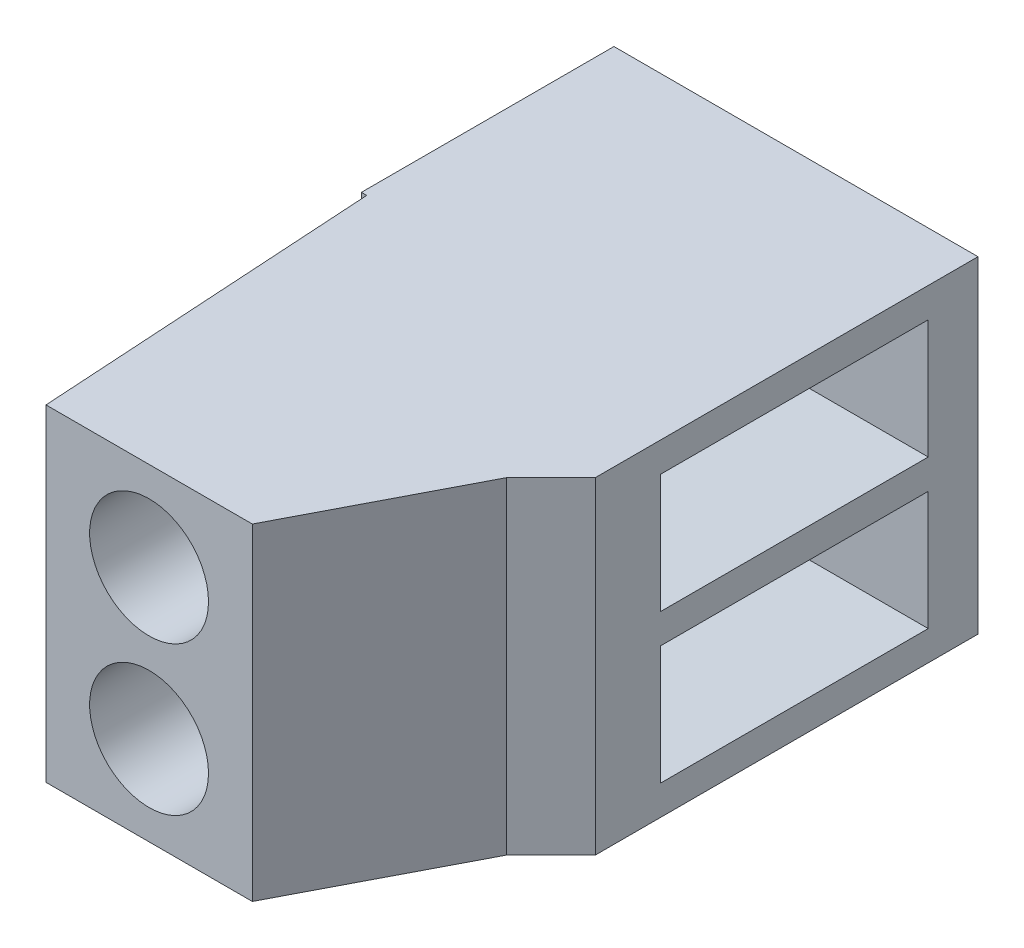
ISO-10303-21;
HEADER;
FILE_DESCRIPTION(('STEP AP214'),'2;1');
FILE_NAME('part.step','',(''),(''),'','','');
FILE_SCHEMA(('AUTOMOTIVE_DESIGN { 1 0 10303 214 1 1 1 1 }'));
ENDSEC;
DATA;
#1=APPLICATION_CONTEXT('core data for automotive mechanical design processes');
#2=APPLICATION_PROTOCOL_DEFINITION('international standard','automotive_design',2000,#1);
#3=PRODUCT_CONTEXT('',#1,'mechanical');
#4=PRODUCT('Part','Part','',(#3));
#5=PRODUCT_RELATED_PRODUCT_CATEGORY('part','',(#4));
#6=PRODUCT_DEFINITION_FORMATION('','',#4);
#7=PRODUCT_DEFINITION_CONTEXT('part definition',#1,'design');
#8=PRODUCT_DEFINITION('design','',#6,#7);
#9=PRODUCT_DEFINITION_SHAPE('','',#8);
#10=(LENGTH_UNIT() NAMED_UNIT(*) SI_UNIT(.MILLI.,.METRE.));
#11=(NAMED_UNIT(*) PLANE_ANGLE_UNIT() SI_UNIT($,.RADIAN.));
#12=(NAMED_UNIT(*) SI_UNIT($,.STERADIAN.) SOLID_ANGLE_UNIT());
#13=UNCERTAINTY_MEASURE_WITH_UNIT(LENGTH_MEASURE(1.E-05),#10,'distance_accuracy_value','');
#14=(GEOMETRIC_REPRESENTATION_CONTEXT(3) GLOBAL_UNCERTAINTY_ASSIGNED_CONTEXT((#13)) GLOBAL_UNIT_ASSIGNED_CONTEXT((#10,
#11,#12)) REPRESENTATION_CONTEXT('',''));
#15=CARTESIAN_POINT('',(0.,0.,0.));
#16=DIRECTION('',(0.,0.,1.));
#17=DIRECTION('',(1.,0.,0.));
#18=AXIS2_PLACEMENT_3D('',#15,#16,#17);
#19=CARTESIAN_POINT('',(0.,-14.7083329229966,-1.13686837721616E-10));
#20=DIRECTION('',(1.,0.,0.));
#21=DIRECTION('',(0.,0.,-1.));
#22=AXIS2_PLACEMENT_3D('',#19,#20,#21);
#23=PLANE('',#22);
#24=DIRECTION('',(0.,-1.,0.));
#25=VECTOR('',#24,1.);
#26=CARTESIAN_POINT('',(0.,-2.286,0.850899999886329));
#27=LINE('',#26,#25);
#28=CARTESIAN_POINT('',(0.,-0.253999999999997,0.850899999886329));
#29=VERTEX_POINT('',#28);
#30=CARTESIAN_POINT('',(0.,-2.286,0.850899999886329));
#31=VERTEX_POINT('',#30);
#32=EDGE_CURVE('E201',#29,#31,#27,.T.);
#33=ORIENTED_EDGE('',*,*,#32,.T.);
#34=DIRECTION('',(0.,0.,1.));
#35=VECTOR('',#34,1.);
#36=CARTESIAN_POINT('',(0.,-2.286,5.42655074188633));
#37=LINE('',#36,#35);
#38=CARTESIAN_POINT('',(0.,-2.286,5.42655074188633));
#39=VERTEX_POINT('',#38);
#40=EDGE_CURVE('E63',#31,#39,#37,.T.);
#41=ORIENTED_EDGE('',*,*,#40,.T.);
#42=DIRECTION('',(0.,1.,0.));
#43=VECTOR('',#42,1.);
#44=CARTESIAN_POINT('',(0.,-2.286,5.42655074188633));
#45=LINE('',#44,#43);
#46=CARTESIAN_POINT('',(0.,-0.253999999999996,5.42655074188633));
#47=VERTEX_POINT('',#46);
#48=EDGE_CURVE('E195',#39,#47,#45,.T.);
#49=ORIENTED_EDGE('',*,*,#48,.T.);
#50=DIRECTION('',(0.,0.,-1.));
#51=VECTOR('',#50,1.);
#52=CARTESIAN_POINT('',(0.,-0.253999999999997,0.850899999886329));
#53=LINE('',#52,#51);
#54=EDGE_CURVE('E198',#47,#29,#53,.T.);
#55=ORIENTED_EDGE('',*,*,#54,.T.);
#56=EDGE_LOOP('',(#33,#41,#49,#55));
#57=FACE_BOUND('',#56,.T.);
#58=DIRECTION('',(0.,0.,1.));
#59=VECTOR('',#58,1.);
#60=CARTESIAN_POINT('',(0.,-2.794,-1.13686837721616E-10));
#61=LINE('',#60,#59);
#62=CARTESIAN_POINT('',(0.,-2.794,-1.13686837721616E-10));
#63=VERTEX_POINT('',#62);
#64=CARTESIAN_POINT('',(0.,-2.794,6.54264108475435));
#65=VERTEX_POINT('',#64);
#66=EDGE_CURVE('E253',#63,#65,#61,.T.);
#67=ORIENTED_EDGE('',*,*,#66,.F.);
#68=DIRECTION('',(0.,-1.,0.));
#69=VECTOR('',#68,1.);
#70=CARTESIAN_POINT('',(0.,2.79399999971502,-1.13686837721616E-10));
#71=LINE('',#70,#69);
#72=CARTESIAN_POINT('',(0.,2.79399999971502,-1.13686837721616E-10));
#73=VERTEX_POINT('',#72);
#74=EDGE_CURVE('E207',#73,#63,#71,.T.);
#75=ORIENTED_EDGE('',*,*,#74,.F.);
#76=DIRECTION('',(0.,0.,-1.));
#77=VECTOR('',#76,1.);
#78=CARTESIAN_POINT('',(0.,2.79399999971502,-1.13686837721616E-10));
#79=LINE('',#78,#77);
#80=CARTESIAN_POINT('',(0.,2.79399999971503,6.54264108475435));
#81=VERTEX_POINT('',#80);
#82=EDGE_CURVE('E235',#81,#73,#79,.T.);
#83=ORIENTED_EDGE('',*,*,#82,.F.);
#84=DIRECTION('',(0.,1.,0.));
#85=VECTOR('',#84,1.);
#86=CARTESIAN_POINT('',(0.,-14.7083329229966,6.54264108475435));
#87=LINE('',#86,#85);
#88=EDGE_CURVE('E243',#65,#81,#87,.T.);
#89=ORIENTED_EDGE('',*,*,#88,.F.);
#90=EDGE_LOOP('',(#67,#75,#83,#89));
#91=FACE_BOUND('',#90,.T.);
#92=DIRECTION('',(0.,1.,0.));
#93=VECTOR('',#92,1.);
#94=CARTESIAN_POINT('',(0.,0.254000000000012,5.42655074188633));
#95=LINE('',#94,#93);
#96=CARTESIAN_POINT('',(0.,0.254000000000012,5.42655074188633));
#97=VERTEX_POINT('',#96);
#98=CARTESIAN_POINT('',(0.,2.286,5.42655074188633));
#99=VERTEX_POINT('',#98);
#100=EDGE_CURVE('E177',#97,#99,#95,.T.);
#101=ORIENTED_EDGE('',*,*,#100,.T.);
#102=DIRECTION('',(0.,0.,-1.));
#103=VECTOR('',#102,1.);
#104=CARTESIAN_POINT('',(0.,2.28600000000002,0.850899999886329));
#105=LINE('',#104,#103);
#106=CARTESIAN_POINT('',(0.,2.28600000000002,0.850899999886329));
#107=VERTEX_POINT('',#106);
#108=EDGE_CURVE('E55',#99,#107,#105,.T.);
#109=ORIENTED_EDGE('',*,*,#108,.T.);
#110=DIRECTION('',(0.,-1.,0.));
#111=VECTOR('',#110,1.);
#112=CARTESIAN_POINT('',(0.,0.253999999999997,0.850899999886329));
#113=LINE('',#112,#111);
#114=CARTESIAN_POINT('',(0.,0.253999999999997,0.850899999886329));
#115=VERTEX_POINT('',#114);
#116=EDGE_CURVE('E160',#107,#115,#113,.T.);
#117=ORIENTED_EDGE('',*,*,#116,.T.);
#118=DIRECTION('',(0.,0.,1.));
#119=VECTOR('',#118,1.);
#120=CARTESIAN_POINT('',(0.,0.253999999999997,0.850899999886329));
#121=LINE('',#120,#119);
#122=EDGE_CURVE('E168',#115,#97,#121,.T.);
#123=ORIENTED_EDGE('',*,*,#122,.T.);
#124=EDGE_LOOP('',(#101,#109,#117,#123));
#125=FACE_BOUND('',#124,.T.);
#126=ADVANCED_FACE('F40',(#57,#91,#125),#23,.T.);
#127=CARTESIAN_POINT('',(0.,2.794,4.44499999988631));
#128=DIRECTION('',(0.,-1.,0.));
#129=DIRECTION('',(1.,0.,0.));
#130=AXIS2_PLACEMENT_3D('',#127,#128,#129);
#131=PLANE('',#130);
#132=ORIENTED_EDGE('',*,*,#82,.T.);
#133=DIRECTION('',(-1.,0.,0.));
#134=VECTOR('',#133,1.);
#135=CARTESIAN_POINT('',(0.,2.794,-1.13686837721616E-10));
#136=LINE('',#135,#134);
#137=CARTESIAN_POINT('',(-6.22299999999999,2.79399999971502,-1.13686837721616E-10));
#138=VERTEX_POINT('',#137);
#139=EDGE_CURVE('E48',#73,#138,#136,.T.);
#140=ORIENTED_EDGE('',*,*,#139,.T.);
#141=DIRECTION('',(0.,0.,1.));
#142=VECTOR('',#141,1.);
#143=CARTESIAN_POINT('',(-6.22299999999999,2.79399999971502,-1.13686837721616E-10));
#144=LINE('',#143,#142);
#145=CARTESIAN_POINT('',(-6.22299999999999,2.79399999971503,4.3179999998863));
#146=VERTEX_POINT('',#145);
#147=EDGE_CURVE('E263',#138,#146,#144,.T.);
#148=ORIENTED_EDGE('',*,*,#147,.T.);
#149=DIRECTION('',(1.,0.,0.));
#150=VECTOR('',#149,1.);
#151=CARTESIAN_POINT('',(-6.22299999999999,2.79399999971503,4.3179999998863));
#152=LINE('',#151,#150);
#153=CARTESIAN_POINT('',(-6.1321429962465,2.79399999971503,4.3179999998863));
#154=VERTEX_POINT('',#153);
#155=EDGE_CURVE('E284',#146,#154,#152,.T.);
#156=ORIENTED_EDGE('',*,*,#155,.T.);
#157=DIRECTION('',(0.0615373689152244,0.,0.998104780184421));
#158=VECTOR('',#157,1.);
#159=CARTESIAN_POINT('',(-5.77195905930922,2.79399999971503,10.1599999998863));
#160=LINE('',#159,#158);
#161=CARTESIAN_POINT('',(-5.77195905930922,2.79399999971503,10.1599999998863));
#162=VERTEX_POINT('',#161);
#163=EDGE_CURVE('E286',#154,#162,#160,.T.);
#164=ORIENTED_EDGE('',*,*,#163,.T.);
#165=DIRECTION('',(1.,0.,0.));
#166=VECTOR('',#165,1.);
#167=CARTESIAN_POINT('',(-2.24493868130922,2.79399999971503,10.1599999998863));
#168=LINE('',#167,#166);
#169=CARTESIAN_POINT('',(-2.24493868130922,2.79399999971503,10.1599999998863));
#170=VERTEX_POINT('',#169);
#171=EDGE_CURVE('E292',#162,#170,#168,.T.);
#172=ORIENTED_EDGE('',*,*,#171,.T.);
#173=DIRECTION('',(0.461152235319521,0.,-0.887321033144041));
#174=VECTOR('',#173,1.);
#175=CARTESIAN_POINT('',(-0.759858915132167,2.79399999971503,7.3024999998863));
#176=LINE('',#175,#174);
#177=CARTESIAN_POINT('',(-0.759858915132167,2.79399999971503,7.3024999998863));
#178=VERTEX_POINT('',#177);
#179=EDGE_CURVE('E296',#170,#178,#176,.T.);
#180=ORIENTED_EDGE('',*,*,#179,.T.);
#181=DIRECTION('',(0.707106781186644,0.,-0.707106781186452));
#182=VECTOR('',#181,1.);
#183=CARTESIAN_POINT('',(-0.759858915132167,2.79399999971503,7.3024999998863));
#184=LINE('',#183,#182);
#185=EDGE_CURVE('E279',#178,#81,#184,.T.);
#186=ORIENTED_EDGE('',*,*,#185,.T.);
#187=EDGE_LOOP('',(#132,#140,#148,#156,#164,#172,#180,#186));
#188=FACE_BOUND('',#187,.T.);
#189=ADVANCED_FACE('F42',(#188),#131,.F.);
#190=CARTESIAN_POINT('',(2.53999999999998,-2.79399999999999,4.44499999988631));
#191=DIRECTION('',(0.,1.,0.));
#192=DIRECTION('',(-1.,0.,0.));
#193=AXIS2_PLACEMENT_3D('',#190,#191,#192);
#194=PLANE('',#193);
#195=DIRECTION('',(1.,0.,0.));
#196=VECTOR('',#195,1.);
#197=CARTESIAN_POINT('',(2.53999999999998,-2.79399999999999,-1.13686837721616E-10));
#198=LINE('',#197,#196);
#199=CARTESIAN_POINT('',(-6.22299999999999,-2.79400000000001,-1.13686837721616E-10));
#200=VERTEX_POINT('',#199);
#201=EDGE_CURVE('E11',#200,#63,#198,.T.);
#202=ORIENTED_EDGE('',*,*,#201,.T.);
#203=ORIENTED_EDGE('',*,*,#66,.T.);
#204=DIRECTION('',(-0.707106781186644,0.,0.707106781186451));
#205=VECTOR('',#204,1.);
#206=CARTESIAN_POINT('',(-0.759858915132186,-2.794,7.30249999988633));
#207=LINE('',#206,#205);
#208=CARTESIAN_POINT('',(-0.75985891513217,-2.794,7.3024999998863));
#209=VERTEX_POINT('',#208);
#210=EDGE_CURVE('E251',#65,#209,#207,.T.);
#211=ORIENTED_EDGE('',*,*,#210,.T.);
#212=DIRECTION('',(-0.461152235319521,0.,0.887321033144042));
#213=VECTOR('',#212,1.);
#214=CARTESIAN_POINT('',(-0.759858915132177,-2.794,7.30249999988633));
#215=LINE('',#214,#213);
#216=CARTESIAN_POINT('',(-2.24493868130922,-2.794,10.1599999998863));
#217=VERTEX_POINT('',#216);
#218=EDGE_CURVE('E249',#209,#217,#215,.T.);
#219=ORIENTED_EDGE('',*,*,#218,.T.);
#220=DIRECTION('',(-1.,0.,0.));
#221=VECTOR('',#220,1.);
#222=CARTESIAN_POINT('',(-2.24493868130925,-2.794,10.1599999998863));
#223=LINE('',#222,#221);
#224=CARTESIAN_POINT('',(-5.77195905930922,-2.79400000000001,10.1599999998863));
#225=VERTEX_POINT('',#224);
#226=EDGE_CURVE('E247',#217,#225,#223,.T.);
#227=ORIENTED_EDGE('',*,*,#226,.T.);
#228=DIRECTION('',(-0.0615373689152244,0.,-0.998104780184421));
#229=VECTOR('',#228,1.);
#230=CARTESIAN_POINT('',(-5.77195905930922,-2.79400000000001,10.1599999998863));
#231=LINE('',#230,#229);
#232=CARTESIAN_POINT('',(-6.1321429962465,-2.79400000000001,4.3179999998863));
#233=VERTEX_POINT('',#232);
#234=EDGE_CURVE('E245',#225,#233,#231,.T.);
#235=ORIENTED_EDGE('',*,*,#234,.T.);
#236=DIRECTION('',(-1.,0.,0.));
#237=VECTOR('',#236,1.);
#238=CARTESIAN_POINT('',(-6.22300000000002,-2.79400000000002,4.3179999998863));
#239=LINE('',#238,#237);
#240=CARTESIAN_POINT('',(-6.22299999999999,-2.79400000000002,4.3179999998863));
#241=VERTEX_POINT('',#240);
#242=EDGE_CURVE('E242',#233,#241,#239,.T.);
#243=ORIENTED_EDGE('',*,*,#242,.T.);
#244=DIRECTION('',(0.,0.,-1.));
#245=VECTOR('',#244,1.);
#246=CARTESIAN_POINT('',(-6.22299999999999,-2.79400000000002,-1.13686837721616E-10));
#247=LINE('',#246,#245);
#248=EDGE_CURVE('E239',#241,#200,#247,.T.);
#249=ORIENTED_EDGE('',*,*,#248,.T.);
#250=EDGE_LOOP('',(#202,#203,#211,#219,#227,#235,#243,#249));
#251=FACE_BOUND('',#250,.T.);
#252=ADVANCED_FACE('F337',(#251),#194,.F.);
#253=CARTESIAN_POINT('',(2.53999999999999,2.79399999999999,-1.13686837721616E-10));
#254=DIRECTION('',(0.,0.,1.));
#255=DIRECTION('',(1.,0.,0.));
#256=AXIS2_PLACEMENT_3D('',#253,#254,#255);
#257=PLANE('',#256);
#258=ORIENTED_EDGE('',*,*,#139,.F.);
#259=ORIENTED_EDGE('',*,*,#74,.T.);
#260=ORIENTED_EDGE('',*,*,#201,.F.);
#261=DIRECTION('',(0.,1.,0.));
#262=VECTOR('',#261,1.);
#263=CARTESIAN_POINT('',(-6.22299999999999,-14.7083329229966,-1.13686837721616E-10));
#264=LINE('',#263,#262);
#265=EDGE_CURVE('E261',#200,#138,#264,.T.);
#266=ORIENTED_EDGE('',*,*,#265,.T.);
#267=EDGE_LOOP('',(#258,#259,#260,#266));
#268=FACE_BOUND('',#267,.T.);
#269=ADVANCED_FACE('F275',(#268),#257,.F.);
#270=CARTESIAN_POINT('',(-0.759858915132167,-14.7083329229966,7.3024999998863));
#271=DIRECTION('',(0.707106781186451,0.,0.707106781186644));
#272=DIRECTION('',(0.707106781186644,0.,-0.707106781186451));
#273=AXIS2_PLACEMENT_3D('',#270,#271,#272);
#274=PLANE('',#273);
#275=ORIENTED_EDGE('',*,*,#210,.F.);
#276=ORIENTED_EDGE('',*,*,#88,.T.);
#277=ORIENTED_EDGE('',*,*,#185,.F.);
#278=DIRECTION('',(0.,1.,0.));
#279=VECTOR('',#278,1.);
#280=CARTESIAN_POINT('',(-0.759858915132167,-14.7083329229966,7.3024999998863));
#281=LINE('',#280,#279);
#282=EDGE_CURVE('E301',#209,#178,#281,.T.);
#283=ORIENTED_EDGE('',*,*,#282,.F.);
#284=EDGE_LOOP('',(#275,#276,#277,#283));
#285=FACE_BOUND('',#284,.T.);
#286=ADVANCED_FACE('F333',(#285),#274,.T.);
#287=CARTESIAN_POINT('',(-0.759858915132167,-14.7083329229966,7.3024999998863));
#288=DIRECTION('',(0.887321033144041,0.,0.461152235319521));
#289=DIRECTION('',(0.461152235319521,0.,-0.887321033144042));
#290=AXIS2_PLACEMENT_3D('',#287,#288,#289);
#291=PLANE('',#290);
#292=ORIENTED_EDGE('',*,*,#218,.F.);
#293=ORIENTED_EDGE('',*,*,#282,.T.);
#294=ORIENTED_EDGE('',*,*,#179,.F.);
#295=DIRECTION('',(0.,1.,0.));
#296=VECTOR('',#295,1.);
#297=CARTESIAN_POINT('',(-2.24493868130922,-14.7083329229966,10.1599999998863));
#298=LINE('',#297,#296);
#299=EDGE_CURVE('E303',#217,#170,#298,.T.);
#300=ORIENTED_EDGE('',*,*,#299,.F.);
#301=EDGE_LOOP('',(#292,#293,#294,#300));
#302=FACE_BOUND('',#301,.T.);
#303=ADVANCED_FACE('F329',(#302),#291,.T.);
#304=CARTESIAN_POINT('',(-2.24493868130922,-14.7083329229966,10.1599999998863));
#305=DIRECTION('',(0.,0.,1.));
#306=DIRECTION('',(1.,0.,0.));
#307=AXIS2_PLACEMENT_3D('',#304,#305,#306);
#308=PLANE('',#307);
#309=CARTESIAN_POINT('',(-4.01023868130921,-1.27,10.159999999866));
#310=DIRECTION('',(0.,0.,1.));
#311=DIRECTION('',(1.,0.,0.));
#312=AXIS2_PLACEMENT_3D('',#309,#310,#311);
#313=CIRCLE('',#312,1.01599999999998);
#314=CARTESIAN_POINT('',(-2.99423868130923,-1.27,10.159999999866));
#315=VERTEX_POINT('',#314);
#316=EDGE_CURVE('E224',#315,#315,#313,.T.);
#317=ORIENTED_EDGE('',*,*,#316,.F.);
#318=EDGE_LOOP('',(#317));
#319=FACE_BOUND('',#318,.T.);
#320=CARTESIAN_POINT('',(-4.0102386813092,1.27,10.159999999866));
#321=DIRECTION('',(0.,0.,1.));
#322=DIRECTION('',(1.,0.,0.));
#323=AXIS2_PLACEMENT_3D('',#320,#321,#322);
#324=CIRCLE('',#323,1.01599999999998);
#325=CARTESIAN_POINT('',(-2.99423868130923,1.27,10.159999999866));
#326=VERTEX_POINT('',#325);
#327=EDGE_CURVE('E228',#326,#326,#324,.T.);
#328=ORIENTED_EDGE('',*,*,#327,.F.);
#329=EDGE_LOOP('',(#328));
#330=FACE_BOUND('',#329,.T.);
#331=ORIENTED_EDGE('',*,*,#226,.F.);
#332=ORIENTED_EDGE('',*,*,#299,.T.);
#333=ORIENTED_EDGE('',*,*,#171,.F.);
#334=DIRECTION('',(0.,1.,0.));
#335=VECTOR('',#334,1.);
#336=CARTESIAN_POINT('',(-5.77195905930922,-14.7083329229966,10.1599999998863));
#337=LINE('',#336,#335);
#338=EDGE_CURVE('E305',#225,#162,#337,.T.);
#339=ORIENTED_EDGE('',*,*,#338,.F.);
#340=EDGE_LOOP('',(#331,#332,#333,#339));
#341=FACE_BOUND('',#340,.T.);
#342=ADVANCED_FACE('F325',(#319,#330,#341),#308,.T.);
#343=CARTESIAN_POINT('',(-5.77195905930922,-14.7083329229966,10.1599999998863));
#344=DIRECTION('',(-0.998104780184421,0.,0.0615373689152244));
#345=DIRECTION('',(0.0615373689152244,0.,0.998104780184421));
#346=AXIS2_PLACEMENT_3D('',#343,#344,#345);
#347=PLANE('',#346);
#348=ORIENTED_EDGE('',*,*,#234,.F.);
#349=ORIENTED_EDGE('',*,*,#338,.T.);
#350=ORIENTED_EDGE('',*,*,#163,.F.);
#351=DIRECTION('',(0.,1.,0.));
#352=VECTOR('',#351,1.);
#353=CARTESIAN_POINT('',(-6.1321429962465,-14.7083329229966,4.3179999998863));
#354=LINE('',#353,#352);
#355=EDGE_CURVE('E308',#233,#154,#354,.T.);
#356=ORIENTED_EDGE('',*,*,#355,.F.);
#357=EDGE_LOOP('',(#348,#349,#350,#356));
#358=FACE_BOUND('',#357,.T.);
#359=ADVANCED_FACE('F318',(#358),#347,.T.);
#360=CARTESIAN_POINT('',(-6.22299999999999,-14.7083329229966,4.3179999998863));
#361=DIRECTION('',(0.,0.,1.));
#362=DIRECTION('',(1.,0.,0.));
#363=AXIS2_PLACEMENT_3D('',#360,#361,#362);
#364=PLANE('',#363);
#365=ORIENTED_EDGE('',*,*,#242,.F.);
#366=ORIENTED_EDGE('',*,*,#355,.T.);
#367=ORIENTED_EDGE('',*,*,#155,.F.);
#368=DIRECTION('',(0.,1.,0.));
#369=VECTOR('',#368,1.);
#370=CARTESIAN_POINT('',(-6.22299999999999,-14.7083329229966,4.3179999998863));
#371=LINE('',#370,#369);
#372=EDGE_CURVE('E278',#241,#146,#371,.T.);
#373=ORIENTED_EDGE('',*,*,#372,.F.);
#374=EDGE_LOOP('',(#365,#366,#367,#373));
#375=FACE_BOUND('',#374,.T.);
#376=ADVANCED_FACE('F315',(#375),#364,.T.);
#377=CARTESIAN_POINT('',(-6.22299999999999,-14.7083329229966,-1.13686837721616E-10));
#378=DIRECTION('',(-1.,0.,0.));
#379=DIRECTION('',(0.,0.,1.));
#380=AXIS2_PLACEMENT_3D('',#377,#378,#379);
#381=PLANE('',#380);
#382=ORIENTED_EDGE('',*,*,#248,.F.);
#383=ORIENTED_EDGE('',*,*,#372,.T.);
#384=ORIENTED_EDGE('',*,*,#147,.F.);
#385=ORIENTED_EDGE('',*,*,#265,.F.);
#386=EDGE_LOOP('',(#382,#383,#384,#385));
#387=FACE_BOUND('',#386,.T.);
#388=ADVANCED_FACE('F280',(#387),#381,.T.);
#389=CARTESIAN_POINT('',(-4.0102386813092,1.27,7.61999999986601));
#390=DIRECTION('',(0.,0.,1.));
#391=DIRECTION('',(1.,0.,0.));
#392=AXIS2_PLACEMENT_3D('',#389,#390,#391);
#393=CYLINDRICAL_SURFACE('',#392,1.01599999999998);
#394=CARTESIAN_POINT('',(-4.0102386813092,1.27,7.61999999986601));
#395=DIRECTION('',(0.,0.,1.));
#396=DIRECTION('',(1.,0.,0.));
#397=AXIS2_PLACEMENT_3D('',#394,#395,#396);
#398=CIRCLE('',#397,1.01599999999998);
#399=CARTESIAN_POINT('',(-2.99423868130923,1.27,7.61999999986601));
#400=VERTEX_POINT('',#399);
#401=EDGE_CURVE('E231',#400,#400,#398,.T.);
#402=ORIENTED_EDGE('',*,*,#401,.F.);
#403=EDGE_LOOP('',(#402));
#404=FACE_BOUND('',#403,.T.);
#405=ORIENTED_EDGE('',*,*,#327,.T.);
#406=EDGE_LOOP('',(#405));
#407=FACE_BOUND('',#406,.T.);
#408=ADVANCED_FACE('F352',(#404,#407),#393,.F.);
#409=CARTESIAN_POINT('',(-4.0102386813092,1.27,7.61999999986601));
#410=DIRECTION('',(0.,0.,1.));
#411=DIRECTION('',(1.,0.,0.));
#412=AXIS2_PLACEMENT_3D('',#409,#410,#411);
#413=PLANE('',#412);
#414=ORIENTED_EDGE('',*,*,#401,.T.);
#415=EDGE_LOOP('',(#414));
#416=FACE_BOUND('',#415,.T.);
#417=ADVANCED_FACE('F366',(#416),#413,.T.);
#418=CARTESIAN_POINT('',(-4.01023868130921,-1.27,7.61999999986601));
#419=DIRECTION('',(0.,0.,1.));
#420=DIRECTION('',(1.,0.,0.));
#421=AXIS2_PLACEMENT_3D('',#418,#419,#420);
#422=CYLINDRICAL_SURFACE('',#421,1.01599999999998);
#423=CARTESIAN_POINT('',(-4.01023868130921,-1.27,7.61999999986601));
#424=DIRECTION('',(0.,0.,1.));
#425=DIRECTION('',(1.,0.,0.));
#426=AXIS2_PLACEMENT_3D('',#423,#424,#425);
#427=CIRCLE('',#426,1.01599999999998);
#428=CARTESIAN_POINT('',(-2.99423868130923,-1.27,7.61999999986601));
#429=VERTEX_POINT('',#428);
#430=EDGE_CURVE('E225',#429,#429,#427,.T.);
#431=ORIENTED_EDGE('',*,*,#430,.F.);
#432=EDGE_LOOP('',(#431));
#433=FACE_BOUND('',#432,.T.);
#434=ORIENTED_EDGE('',*,*,#316,.T.);
#435=EDGE_LOOP('',(#434));
#436=FACE_BOUND('',#435,.T.);
#437=ADVANCED_FACE('F370',(#433,#436),#422,.F.);
#438=CARTESIAN_POINT('',(-4.01023868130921,-1.27,7.61999999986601));
#439=DIRECTION('',(0.,0.,1.));
#440=DIRECTION('',(1.,0.,0.));
#441=AXIS2_PLACEMENT_3D('',#438,#439,#440);
#442=PLANE('',#441);
#443=ORIENTED_EDGE('',*,*,#430,.T.);
#444=EDGE_LOOP('',(#443));
#445=FACE_BOUND('',#444,.T.);
#446=ADVANCED_FACE('F374',(#445),#442,.T.);
#447=CARTESIAN_POINT('',(0.,-2.286,5.42655074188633));
#448=DIRECTION('',(-0.17364817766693,-0.984807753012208,0.));
#449=DIRECTION('',(0.984807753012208,-0.17364817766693,0.));
#450=AXIS2_PLACEMENT_3D('',#447,#448,#449);
#451=PLANE('',#450);
#452=ORIENTED_EDGE('',*,*,#40,.F.);
#453=DIRECTION('',(0.970287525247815,-0.171087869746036,-0.171087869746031));
#454=VECTOR('',#453,1.);
#455=CARTESIAN_POINT('',(-0.75957827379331,-2.15206585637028,0.98483414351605));
#456=LINE('',#455,#454);
#457=CARTESIAN_POINT('',(-2.00025000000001,-1.93330195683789,1.20359804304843));
#458=VERTEX_POINT('',#457);
#459=EDGE_CURVE('E209',#458,#31,#456,.T.);
#460=ORIENTED_EDGE('',*,*,#459,.F.);
#461=DIRECTION('',(0.,0.,-1.));
#462=VECTOR('',#461,1.);
#463=CARTESIAN_POINT('',(-2.00025000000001,-1.93330195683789,0.850899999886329));
#464=LINE('',#463,#462);
#465=CARTESIAN_POINT('',(-2.00025000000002,-1.93330195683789,5.07385269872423));
#466=VERTEX_POINT('',#465);
#467=EDGE_CURVE('E204',#458,#466,#464,.F.);
#468=ORIENTED_EDGE('',*,*,#467,.T.);
#469=DIRECTION('',(0.970287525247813,-0.171087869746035,0.17108786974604));
#470=VECTOR('',#469,1.);
#471=CARTESIAN_POINT('',(0.,-2.286,5.42655074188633));
#472=LINE('',#471,#470);
#473=EDGE_CURVE('E205',#466,#39,#472,.T.);
#474=ORIENTED_EDGE('',*,*,#473,.T.);
#475=EDGE_LOOP('',(#452,#460,#468,#474));
#476=FACE_BOUND('',#475,.T.);
#477=ADVANCED_FACE('F378',(#476),#451,.F.);
#478=CARTESIAN_POINT('',(0.,-2.286,5.42655074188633));
#479=DIRECTION('',(-0.173648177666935,0.,0.984807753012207));
#480=DIRECTION('',(0.984807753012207,0.,0.173648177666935));
#481=AXIS2_PLACEMENT_3D('',#478,#479,#480);
#482=PLANE('',#481);
#483=ORIENTED_EDGE('',*,*,#48,.F.);
#484=ORIENTED_EDGE('',*,*,#473,.F.);
#485=DIRECTION('',(0.,-1.,0.));
#486=VECTOR('',#485,1.);
#487=CARTESIAN_POINT('',(-2.00025000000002,-2.286,5.07385269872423));
#488=LINE('',#487,#486);
#489=CARTESIAN_POINT('',(-2.00025000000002,-0.606698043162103,5.07385269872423));
#490=VERTEX_POINT('',#489);
#491=EDGE_CURVE('E217',#466,#490,#488,.F.);
#492=ORIENTED_EDGE('',*,*,#491,.T.);
#493=DIRECTION('',(0.970287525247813,0.171087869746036,0.17108786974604));
#494=VECTOR('',#493,1.);
#495=CARTESIAN_POINT('',(-0.759578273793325,-0.387934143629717,5.29261659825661));
#496=LINE('',#495,#494);
#497=EDGE_CURVE('E208',#490,#47,#496,.T.);
#498=ORIENTED_EDGE('',*,*,#497,.T.);
#499=EDGE_LOOP('',(#483,#484,#492,#498));
#500=FACE_BOUND('',#499,.T.);
#501=ADVANCED_FACE('F380',(#500),#482,.F.);
#502=CARTESIAN_POINT('',(0.,-0.253999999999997,0.850899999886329));
#503=DIRECTION('',(-0.17364817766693,0.984807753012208,0.));
#504=DIRECTION('',(-0.984807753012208,-0.17364817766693,0.));
#505=AXIS2_PLACEMENT_3D('',#502,#503,#504);
#506=PLANE('',#505);
#507=ORIENTED_EDGE('',*,*,#54,.F.);
#508=ORIENTED_EDGE('',*,*,#497,.F.);
#509=DIRECTION('',(0.,0.,1.));
#510=VECTOR('',#509,1.);
#511=CARTESIAN_POINT('',(-2.00025,-0.606698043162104,0.850899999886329));
#512=LINE('',#511,#510);
#513=CARTESIAN_POINT('',(-2.00025,-0.606698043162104,1.20359804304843));
#514=VERTEX_POINT('',#513);
#515=EDGE_CURVE('E219',#490,#514,#512,.F.);
#516=ORIENTED_EDGE('',*,*,#515,.T.);
#517=DIRECTION('',(0.970287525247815,0.171087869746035,-0.171087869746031));
#518=VECTOR('',#517,1.);
#519=CARTESIAN_POINT('',(-0.337320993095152,-0.313478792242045,0.91037879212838));
#520=LINE('',#519,#518);
#521=EDGE_CURVE('E211',#514,#29,#520,.T.);
#522=ORIENTED_EDGE('',*,*,#521,.T.);
#523=EDGE_LOOP('',(#507,#508,#516,#522));
#524=FACE_BOUND('',#523,.T.);
#525=ADVANCED_FACE('F383',(#524),#506,.F.);
#526=CARTESIAN_POINT('',(0.,-2.286,0.850899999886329));
#527=DIRECTION('',(-0.173648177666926,0.,-0.984807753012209));
#528=DIRECTION('',(-0.984807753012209,0.,0.173648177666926));
#529=AXIS2_PLACEMENT_3D('',#526,#527,#528);
#530=PLANE('',#529);
#531=ORIENTED_EDGE('',*,*,#32,.F.);
#532=ORIENTED_EDGE('',*,*,#521,.F.);
#533=DIRECTION('',(0.,1.,0.));
#534=VECTOR('',#533,1.);
#535=CARTESIAN_POINT('',(-2.00025000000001,-2.286,1.20359804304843));
#536=LINE('',#535,#534);
#537=EDGE_CURVE('E212',#514,#458,#536,.F.);
#538=ORIENTED_EDGE('',*,*,#537,.T.);
#539=ORIENTED_EDGE('',*,*,#459,.T.);
#540=EDGE_LOOP('',(#531,#532,#538,#539));
#541=FACE_BOUND('',#540,.T.);
#542=ADVANCED_FACE('F387',(#541),#530,.F.);
#543=CARTESIAN_POINT('',(-2.00025000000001,-2.286,0.850899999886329));
#544=DIRECTION('',(1.,0.,0.));
#545=DIRECTION('',(0.,0.,-1.));
#546=AXIS2_PLACEMENT_3D('',#543,#544,#545);
#547=PLANE('',#546);
#548=ORIENTED_EDGE('',*,*,#467,.F.);
#549=ORIENTED_EDGE('',*,*,#537,.F.);
#550=ORIENTED_EDGE('',*,*,#515,.F.);
#551=ORIENTED_EDGE('',*,*,#491,.F.);
#552=EDGE_LOOP('',(#548,#549,#550,#551));
#553=FACE_BOUND('',#552,.T.);
#554=ADVANCED_FACE('F391',(#553),#547,.T.);
#555=CARTESIAN_POINT('',(0.,2.28600000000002,0.850899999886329));
#556=DIRECTION('',(-0.17364817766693,0.984807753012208,0.));
#557=DIRECTION('',(-0.984807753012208,-0.17364817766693,0.));
#558=AXIS2_PLACEMENT_3D('',#555,#556,#557);
#559=PLANE('',#558);
#560=ORIENTED_EDGE('',*,*,#108,.F.);
#561=DIRECTION('',(0.970287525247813,0.171087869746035,0.17108786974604));
#562=VECTOR('',#561,1.);
#563=CARTESIAN_POINT('',(-0.759578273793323,2.15206585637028,5.29261659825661));
#564=LINE('',#563,#562);
#565=CARTESIAN_POINT('',(-2.00025000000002,1.9333019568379,5.07385269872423));
#566=VERTEX_POINT('',#565);
#567=EDGE_CURVE('E182',#566,#99,#564,.T.);
#568=ORIENTED_EDGE('',*,*,#567,.F.);
#569=DIRECTION('',(0.,0.,1.));
#570=VECTOR('',#569,1.);
#571=CARTESIAN_POINT('',(-2.00025,1.93330195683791,0.850899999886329));
#572=LINE('',#571,#570);
#573=CARTESIAN_POINT('',(-2.00025000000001,1.93330195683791,1.20359804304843));
#574=VERTEX_POINT('',#573);
#575=EDGE_CURVE('E173',#566,#574,#572,.F.);
#576=ORIENTED_EDGE('',*,*,#575,.T.);
#577=DIRECTION('',(0.970287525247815,0.171087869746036,-0.171087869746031));
#578=VECTOR('',#577,1.);
#579=CARTESIAN_POINT('',(-0.337320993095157,2.22652120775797,0.91037879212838));
#580=LINE('',#579,#578);
#581=EDGE_CURVE('E162',#574,#107,#580,.T.);
#582=ORIENTED_EDGE('',*,*,#581,.T.);
#583=EDGE_LOOP('',(#560,#568,#576,#582));
#584=FACE_BOUND('',#583,.T.);
#585=ADVANCED_FACE('F171',(#584),#559,.F.);
#586=CARTESIAN_POINT('',(0.,0.253999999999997,0.850899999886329));
#587=DIRECTION('',(-0.173648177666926,0.,-0.984807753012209));
#588=DIRECTION('',(-0.984807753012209,0.,0.173648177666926));
#589=AXIS2_PLACEMENT_3D('',#586,#587,#588);
#590=PLANE('',#589);
#591=ORIENTED_EDGE('',*,*,#116,.F.);
#592=ORIENTED_EDGE('',*,*,#581,.F.);
#593=DIRECTION('',(0.,1.,0.));
#594=VECTOR('',#593,1.);
#595=CARTESIAN_POINT('',(-2.00025,0.253999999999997,1.20359804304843));
#596=LINE('',#595,#594);
#597=CARTESIAN_POINT('',(-2.00025000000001,0.606698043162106,1.20359804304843));
#598=VERTEX_POINT('',#597);
#599=EDGE_CURVE('E189',#574,#598,#596,.F.);
#600=ORIENTED_EDGE('',*,*,#599,.T.);
#601=DIRECTION('',(0.970287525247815,-0.171087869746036,-0.171087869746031));
#602=VECTOR('',#601,1.);
#603=CARTESIAN_POINT('',(0.,0.253999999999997,0.850899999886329));
#604=LINE('',#603,#602);
#605=EDGE_CURVE('E164',#598,#115,#604,.T.);
#606=ORIENTED_EDGE('',*,*,#605,.T.);
#607=EDGE_LOOP('',(#591,#592,#600,#606));
#608=FACE_BOUND('',#607,.T.);
#609=ADVANCED_FACE('F161',(#608),#590,.F.);
#610=CARTESIAN_POINT('',(0.,0.253999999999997,0.850899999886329));
#611=DIRECTION('',(-0.17364817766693,-0.984807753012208,0.));
#612=DIRECTION('',(0.984807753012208,-0.17364817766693,0.));
#613=AXIS2_PLACEMENT_3D('',#610,#611,#612);
#614=PLANE('',#613);
#615=ORIENTED_EDGE('',*,*,#122,.F.);
#616=ORIENTED_EDGE('',*,*,#605,.F.);
#617=DIRECTION('',(0.,0.,-1.));
#618=VECTOR('',#617,1.);
#619=CARTESIAN_POINT('',(-2.00025,0.606698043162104,0.850899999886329));
#620=LINE('',#619,#618);
#621=CARTESIAN_POINT('',(-2.00025000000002,0.606698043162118,5.07385269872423));
#622=VERTEX_POINT('',#621);
#623=EDGE_CURVE('E191',#598,#622,#620,.F.);
#624=ORIENTED_EDGE('',*,*,#623,.T.);
#625=DIRECTION('',(0.970287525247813,-0.171087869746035,0.17108786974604));
#626=VECTOR('',#625,1.);
#627=CARTESIAN_POINT('',(0.,0.254000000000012,5.42655074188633));
#628=LINE('',#627,#626);
#629=EDGE_CURVE('E184',#622,#97,#628,.T.);
#630=ORIENTED_EDGE('',*,*,#629,.T.);
#631=EDGE_LOOP('',(#615,#616,#624,#630));
#632=FACE_BOUND('',#631,.T.);
#633=ADVANCED_FACE('F400',(#632),#614,.F.);
#634=CARTESIAN_POINT('',(0.,0.254000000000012,5.42655074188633));
#635=DIRECTION('',(-0.173648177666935,0.,0.984807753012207));
#636=DIRECTION('',(0.984807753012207,0.,0.173648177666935));
#637=AXIS2_PLACEMENT_3D('',#634,#635,#636);
#638=PLANE('',#637);
#639=ORIENTED_EDGE('',*,*,#100,.F.);
#640=ORIENTED_EDGE('',*,*,#629,.F.);
#641=DIRECTION('',(0.,-1.,0.));
#642=VECTOR('',#641,1.);
#643=CARTESIAN_POINT('',(-2.00025000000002,0.254000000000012,5.07385269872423));
#644=LINE('',#643,#642);
#645=EDGE_CURVE('E185',#622,#566,#644,.F.);
#646=ORIENTED_EDGE('',*,*,#645,.T.);
#647=ORIENTED_EDGE('',*,*,#567,.T.);
#648=EDGE_LOOP('',(#639,#640,#646,#647));
#649=FACE_BOUND('',#648,.T.);
#650=ADVANCED_FACE('F403',(#649),#638,.F.);
#651=CARTESIAN_POINT('',(-2.00025000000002,2.286,5.42655074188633));
#652=DIRECTION('',(-1.,0.,0.));
#653=DIRECTION('',(0.,0.,1.));
#654=AXIS2_PLACEMENT_3D('',#651,#652,#653);
#655=PLANE('',#654);
#656=ORIENTED_EDGE('',*,*,#575,.F.);
#657=ORIENTED_EDGE('',*,*,#645,.F.);
#658=ORIENTED_EDGE('',*,*,#623,.F.);
#659=ORIENTED_EDGE('',*,*,#599,.F.);
#660=EDGE_LOOP('',(#656,#657,#658,#659));
#661=FACE_BOUND('',#660,.T.);
#662=ADVANCED_FACE('F407',(#661),#655,.F.);
#663=CLOSED_SHELL('',(#126,#189,#252,#269,#286,#303,#342,#359,#376,#388,#408,#417,#437,#446,
#477,#501,#525,#542,#554,#585,#609,#633,#650,#662));
#664=MANIFOLD_SOLID_BREP('B2',#663);
#665=ADVANCED_BREP_SHAPE_REPRESENTATION('',(#18,#664),#14);
#666=SHAPE_DEFINITION_REPRESENTATION(#9,#665);
ENDSEC;
END-ISO-10303-21;
